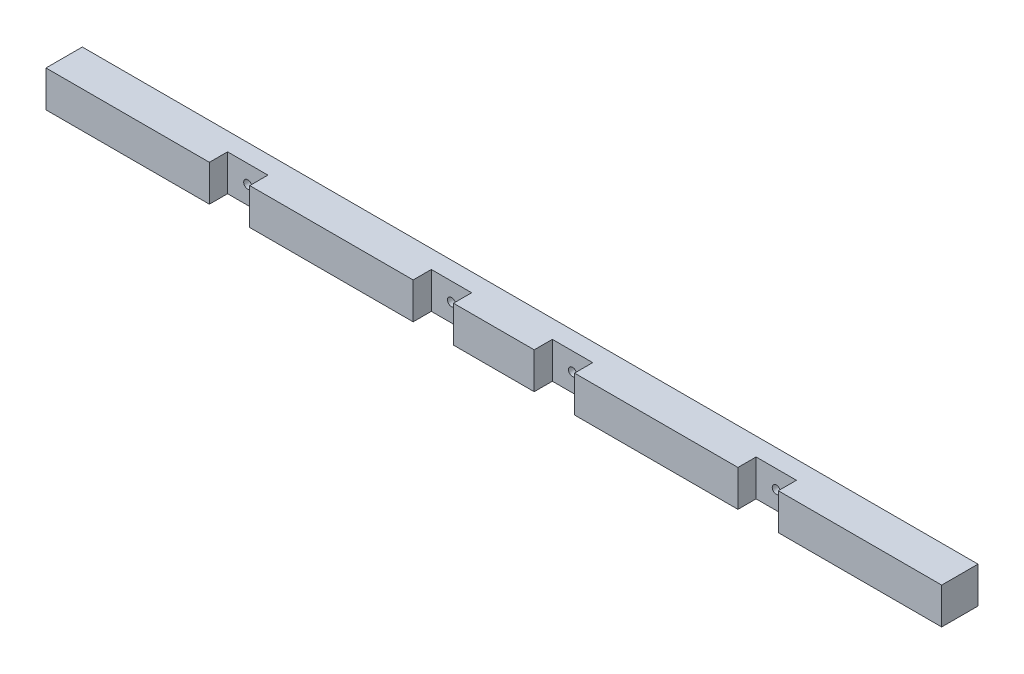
ISO-10303-21;
HEADER;
FILE_DESCRIPTION(('STEP AP214'),'2;1');
FILE_NAME('part.step','',(''),(''),'','','');
FILE_SCHEMA(('AUTOMOTIVE_DESIGN { 1 0 10303 214 1 1 1 1 }'));
ENDSEC;
DATA;
#1=APPLICATION_CONTEXT('core data for automotive mechanical design processes');
#2=APPLICATION_PROTOCOL_DEFINITION('international standard','automotive_design',2000,#1);
#3=PRODUCT_CONTEXT('',#1,'mechanical');
#4=PRODUCT('Part','Part','',(#3));
#5=PRODUCT_RELATED_PRODUCT_CATEGORY('part','',(#4));
#6=PRODUCT_DEFINITION_FORMATION('','',#4);
#7=PRODUCT_DEFINITION_CONTEXT('part definition',#1,'design');
#8=PRODUCT_DEFINITION('design','',#6,#7);
#9=PRODUCT_DEFINITION_SHAPE('','',#8);
#10=(LENGTH_UNIT() NAMED_UNIT(*) SI_UNIT(.MILLI.,.METRE.));
#11=(NAMED_UNIT(*) PLANE_ANGLE_UNIT() SI_UNIT($,.RADIAN.));
#12=(NAMED_UNIT(*) SI_UNIT($,.STERADIAN.) SOLID_ANGLE_UNIT());
#13=UNCERTAINTY_MEASURE_WITH_UNIT(LENGTH_MEASURE(1.E-05),#10,'distance_accuracy_value','');
#14=(GEOMETRIC_REPRESENTATION_CONTEXT(3) GLOBAL_UNCERTAINTY_ASSIGNED_CONTEXT((#13)) GLOBAL_UNIT_ASSIGNED_CONTEXT((#10,
#11,#12)) REPRESENTATION_CONTEXT('',''));
#15=CARTESIAN_POINT('',(0.,0.,0.));
#16=DIRECTION('',(0.,0.,1.));
#17=DIRECTION('',(1.,0.,0.));
#18=AXIS2_PLACEMENT_3D('',#15,#16,#17);
#19=CARTESIAN_POINT('',(0.,9.,9.));
#20=DIRECTION('',(0.,0.,-1.));
#21=DIRECTION('',(-1.,0.,0.));
#22=AXIS2_PLACEMENT_3D('',#19,#20,#21);
#23=PLANE('',#22);
#24=DIRECTION('',(1.,0.,0.));
#25=VECTOR('',#24,1.);
#26=CARTESIAN_POINT('',(0.,0.,9.));
#27=LINE('',#26,#25);
#28=CARTESIAN_POINT('',(131.,0.,9.));
#29=VERTEX_POINT('',#28);
#30=CARTESIAN_POINT('',(171.5,0.,9.));
#31=VERTEX_POINT('',#30);
#32=EDGE_CURVE('E373',#29,#31,#27,.T.);
#33=ORIENTED_EDGE('',*,*,#32,.T.);
#34=DIRECTION('',(0.,-1.,0.));
#35=VECTOR('',#34,1.);
#36=CARTESIAN_POINT('',(171.5,0.,9.));
#37=LINE('',#36,#35);
#38=CARTESIAN_POINT('',(171.5,9.,9.));
#39=VERTEX_POINT('',#38);
#40=EDGE_CURVE('E173',#39,#31,#37,.T.);
#41=ORIENTED_EDGE('',*,*,#40,.F.);
#42=DIRECTION('',(-1.,0.,0.));
#43=VECTOR('',#42,1.);
#44=CARTESIAN_POINT('',(0.,9.,9.));
#45=LINE('',#44,#43);
#46=CARTESIAN_POINT('',(131.,9.,9.));
#47=VERTEX_POINT('',#46);
#48=EDGE_CURVE('E320',#39,#47,#45,.T.);
#49=ORIENTED_EDGE('',*,*,#48,.T.);
#50=DIRECTION('',(0.,1.,0.));
#51=VECTOR('',#50,1.);
#52=CARTESIAN_POINT('',(131.,0.,9.));
#53=LINE('',#52,#51);
#54=EDGE_CURVE('E217',#29,#47,#53,.T.);
#55=ORIENTED_EDGE('',*,*,#54,.F.);
#56=EDGE_LOOP('',(#33,#41,#49,#55));
#57=FACE_BOUND('',#56,.T.);
#58=ADVANCED_FACE('F30',(#57),#23,.F.);
#59=CARTESIAN_POINT('',(101.,0.,9.));
#60=VERTEX_POINT('',#59);
#61=CARTESIAN_POINT('',(121.,0.,9.));
#62=VERTEX_POINT('',#61);
#63=EDGE_CURVE('E374',#60,#62,#27,.T.);
#64=ORIENTED_EDGE('',*,*,#63,.T.);
#65=DIRECTION('',(0.,-1.,0.));
#66=VECTOR('',#65,1.);
#67=CARTESIAN_POINT('',(121.,0.,9.));
#68=LINE('',#67,#66);
#69=CARTESIAN_POINT('',(121.,9.,9.));
#70=VERTEX_POINT('',#69);
#71=EDGE_CURVE('E210',#70,#62,#68,.T.);
#72=ORIENTED_EDGE('',*,*,#71,.F.);
#73=CARTESIAN_POINT('',(101.,9.,9.));
#74=VERTEX_POINT('',#73);
#75=EDGE_CURVE('E357',#70,#74,#45,.T.);
#76=ORIENTED_EDGE('',*,*,#75,.T.);
#77=DIRECTION('',(0.,1.,0.));
#78=VECTOR('',#77,1.);
#79=CARTESIAN_POINT('',(101.,0.,9.));
#80=LINE('',#79,#78);
#81=EDGE_CURVE('E248',#60,#74,#80,.T.);
#82=ORIENTED_EDGE('',*,*,#81,.F.);
#83=EDGE_LOOP('',(#64,#72,#76,#82));
#84=FACE_BOUND('',#83,.T.);
#85=ADVANCED_FACE('F391',(#84),#23,.F.);
#86=CARTESIAN_POINT('',(50.5,0.,9.));
#87=VERTEX_POINT('',#86);
#88=CARTESIAN_POINT('',(91.,0.,9.));
#89=VERTEX_POINT('',#88);
#90=EDGE_CURVE('E313',#87,#89,#27,.T.);
#91=ORIENTED_EDGE('',*,*,#90,.T.);
#92=DIRECTION('',(0.,-1.,0.));
#93=VECTOR('',#92,1.);
#94=CARTESIAN_POINT('',(91.,0.,9.));
#95=LINE('',#94,#93);
#96=CARTESIAN_POINT('',(91.,9.,9.));
#97=VERTEX_POINT('',#96);
#98=EDGE_CURVE('E241',#97,#89,#95,.T.);
#99=ORIENTED_EDGE('',*,*,#98,.F.);
#100=CARTESIAN_POINT('',(50.5,9.,9.));
#101=VERTEX_POINT('',#100);
#102=EDGE_CURVE('E356',#97,#101,#45,.T.);
#103=ORIENTED_EDGE('',*,*,#102,.T.);
#104=DIRECTION('',(0.,1.,0.));
#105=VECTOR('',#104,1.);
#106=CARTESIAN_POINT('',(50.5,9.,9.));
#107=LINE('',#106,#105);
#108=EDGE_CURVE('E281',#87,#101,#107,.T.);
#109=ORIENTED_EDGE('',*,*,#108,.F.);
#110=EDGE_LOOP('',(#91,#99,#103,#109));
#111=FACE_BOUND('',#110,.T.);
#112=ADVANCED_FACE('F396',(#111),#23,.F.);
#113=CARTESIAN_POINT('',(0.,0.,9.));
#114=VERTEX_POINT('',#113);
#115=CARTESIAN_POINT('',(40.5,0.,9.));
#116=VERTEX_POINT('',#115);
#117=EDGE_CURVE('E309',#114,#116,#27,.T.);
#118=ORIENTED_EDGE('',*,*,#117,.T.);
#119=DIRECTION('',(0.,-1.,0.));
#120=VECTOR('',#119,1.);
#121=CARTESIAN_POINT('',(40.5,9.,9.));
#122=LINE('',#121,#120);
#123=CARTESIAN_POINT('',(40.5,9.,9.));
#124=VERTEX_POINT('',#123);
#125=EDGE_CURVE('E274',#124,#116,#122,.T.);
#126=ORIENTED_EDGE('',*,*,#125,.F.);
#127=CARTESIAN_POINT('',(0.,9.,9.));
#128=VERTEX_POINT('',#127);
#129=EDGE_CURVE('E315',#124,#128,#45,.T.);
#130=ORIENTED_EDGE('',*,*,#129,.T.);
#131=DIRECTION('',(0.,-1.,0.));
#132=VECTOR('',#131,1.);
#133=CARTESIAN_POINT('',(0.,0.,9.));
#134=LINE('',#133,#132);
#135=EDGE_CURVE('E304',#128,#114,#134,.T.);
#136=ORIENTED_EDGE('',*,*,#135,.T.);
#137=EDGE_LOOP('',(#118,#126,#130,#136));
#138=FACE_BOUND('',#137,.T.);
#139=ADVANCED_FACE('F353',(#138),#23,.F.);
#140=CARTESIAN_POINT('',(0.,0.,9.));
#141=DIRECTION('',(1.,0.,0.));
#142=DIRECTION('',(0.,0.,-1.));
#143=AXIS2_PLACEMENT_3D('',#140,#141,#142);
#144=PLANE('',#143);
#145=DIRECTION('',(0.,-1.,0.));
#146=VECTOR('',#145,1.);
#147=CARTESIAN_POINT('',(0.,0.,0.));
#148=LINE('',#147,#146);
#149=CARTESIAN_POINT('',(0.,9.,0.));
#150=VERTEX_POINT('',#149);
#151=CARTESIAN_POINT('',(0.,0.,0.));
#152=VERTEX_POINT('',#151);
#153=EDGE_CURVE('E296',#150,#152,#148,.T.);
#154=ORIENTED_EDGE('',*,*,#153,.T.);
#155=DIRECTION('',(0.,0.,-1.));
#156=VECTOR('',#155,1.);
#157=CARTESIAN_POINT('',(0.,0.,9.));
#158=LINE('',#157,#156);
#159=EDGE_CURVE('E11',#114,#152,#158,.T.);
#160=ORIENTED_EDGE('',*,*,#159,.F.);
#161=ORIENTED_EDGE('',*,*,#135,.F.);
#162=DIRECTION('',(0.,0.,-1.));
#163=VECTOR('',#162,1.);
#164=CARTESIAN_POINT('',(0.,9.,9.));
#165=LINE('',#164,#163);
#166=EDGE_CURVE('E319',#128,#150,#165,.T.);
#167=ORIENTED_EDGE('',*,*,#166,.T.);
#168=EDGE_LOOP('',(#154,#160,#161,#167));
#169=FACE_BOUND('',#168,.T.);
#170=ADVANCED_FACE('F32',(#169),#144,.F.);
#171=CARTESIAN_POINT('',(0.,0.,9.));
#172=DIRECTION('',(0.,1.,0.));
#173=DIRECTION('',(0.,0.,1.));
#174=AXIS2_PLACEMENT_3D('',#171,#172,#173);
#175=PLANE('',#174);
#176=DIRECTION('',(1.,0.,0.));
#177=VECTOR('',#176,1.);
#178=CARTESIAN_POINT('',(171.5,0.,4.5));
#179=LINE('',#178,#177);
#180=CARTESIAN_POINT('',(171.5,0.,4.5));
#181=VERTEX_POINT('',#180);
#182=CARTESIAN_POINT('',(181.5,0.,4.5));
#183=VERTEX_POINT('',#182);
#184=EDGE_CURVE('E184',#181,#183,#179,.T.);
#185=ORIENTED_EDGE('',*,*,#184,.F.);
#186=DIRECTION('',(0.,0.,1.));
#187=VECTOR('',#186,1.);
#188=CARTESIAN_POINT('',(171.5,0.,4.5));
#189=LINE('',#188,#187);
#190=EDGE_CURVE('E167',#181,#31,#189,.T.);
#191=ORIENTED_EDGE('',*,*,#190,.T.);
#192=ORIENTED_EDGE('',*,*,#32,.F.);
#193=DIRECTION('',(0.,0.,1.));
#194=VECTOR('',#193,1.);
#195=CARTESIAN_POINT('',(131.,0.,4.5));
#196=LINE('',#195,#194);
#197=CARTESIAN_POINT('',(131.,0.,4.5));
#198=VERTEX_POINT('',#197);
#199=EDGE_CURVE('E53',#198,#29,#196,.T.);
#200=ORIENTED_EDGE('',*,*,#199,.F.);
#201=DIRECTION('',(1.,0.,0.));
#202=VECTOR('',#201,1.);
#203=CARTESIAN_POINT('',(121.,0.,4.5));
#204=LINE('',#203,#202);
#205=CARTESIAN_POINT('',(121.,0.,4.5));
#206=VERTEX_POINT('',#205);
#207=EDGE_CURVE('E216',#206,#198,#204,.T.);
#208=ORIENTED_EDGE('',*,*,#207,.F.);
#209=DIRECTION('',(0.,0.,1.));
#210=VECTOR('',#209,1.);
#211=CARTESIAN_POINT('',(121.,0.,4.5));
#212=LINE('',#211,#210);
#213=EDGE_CURVE('E226',#206,#62,#212,.T.);
#214=ORIENTED_EDGE('',*,*,#213,.T.);
#215=ORIENTED_EDGE('',*,*,#63,.F.);
#216=DIRECTION('',(0.,0.,1.));
#217=VECTOR('',#216,1.);
#218=CARTESIAN_POINT('',(101.,0.,4.5));
#219=LINE('',#218,#217);
#220=CARTESIAN_POINT('',(101.,0.,4.5));
#221=VERTEX_POINT('',#220);
#222=EDGE_CURVE('E267',#221,#60,#219,.T.);
#223=ORIENTED_EDGE('',*,*,#222,.F.);
#224=DIRECTION('',(1.,0.,0.));
#225=VECTOR('',#224,1.);
#226=CARTESIAN_POINT('',(91.,0.,4.5));
#227=LINE('',#226,#225);
#228=CARTESIAN_POINT('',(91.,0.,4.5));
#229=VERTEX_POINT('',#228);
#230=EDGE_CURVE('E247',#229,#221,#227,.T.);
#231=ORIENTED_EDGE('',*,*,#230,.F.);
#232=DIRECTION('',(0.,0.,1.));
#233=VECTOR('',#232,1.);
#234=CARTESIAN_POINT('',(91.,0.,4.5));
#235=LINE('',#234,#233);
#236=EDGE_CURVE('E257',#229,#89,#235,.T.);
#237=ORIENTED_EDGE('',*,*,#236,.T.);
#238=ORIENTED_EDGE('',*,*,#90,.F.);
#239=DIRECTION('',(0.,0.,1.));
#240=VECTOR('',#239,1.);
#241=CARTESIAN_POINT('',(50.5,0.,4.5));
#242=LINE('',#241,#240);
#243=CARTESIAN_POINT('',(50.5,0.,4.5));
#244=VERTEX_POINT('',#243);
#245=EDGE_CURVE('E300',#244,#87,#242,.T.);
#246=ORIENTED_EDGE('',*,*,#245,.F.);
#247=DIRECTION('',(1.,0.,0.));
#248=VECTOR('',#247,1.);
#249=CARTESIAN_POINT('',(40.5,0.,4.5));
#250=LINE('',#249,#248);
#251=CARTESIAN_POINT('',(40.5,0.,4.5));
#252=VERTEX_POINT('',#251);
#253=EDGE_CURVE('E280',#252,#244,#250,.T.);
#254=ORIENTED_EDGE('',*,*,#253,.F.);
#255=DIRECTION('',(0.,0.,1.));
#256=VECTOR('',#255,1.);
#257=CARTESIAN_POINT('',(40.5,0.,4.5));
#258=LINE('',#257,#256);
#259=EDGE_CURVE('E290',#252,#116,#258,.T.);
#260=ORIENTED_EDGE('',*,*,#259,.T.);
#261=ORIENTED_EDGE('',*,*,#117,.F.);
#262=ORIENTED_EDGE('',*,*,#159,.T.);
#263=DIRECTION('',(1.,0.,0.));
#264=VECTOR('',#263,1.);
#265=CARTESIAN_POINT('',(0.,0.,0.));
#266=LINE('',#265,#264);
#267=CARTESIAN_POINT('',(222.,0.,0.));
#268=VERTEX_POINT('',#267);
#269=EDGE_CURVE('E323',#152,#268,#266,.T.);
#270=ORIENTED_EDGE('',*,*,#269,.T.);
#271=DIRECTION('',(0.,0.,-1.));
#272=VECTOR('',#271,1.);
#273=CARTESIAN_POINT('',(222.,0.,9.));
#274=LINE('',#273,#272);
#275=CARTESIAN_POINT('',(222.,0.,9.));
#276=VERTEX_POINT('',#275);
#277=EDGE_CURVE('E38',#276,#268,#274,.T.);
#278=ORIENTED_EDGE('',*,*,#277,.F.);
#279=CARTESIAN_POINT('',(181.5,0.,9.));
#280=VERTEX_POINT('',#279);
#281=EDGE_CURVE('E307',#280,#276,#27,.T.);
#282=ORIENTED_EDGE('',*,*,#281,.F.);
#283=DIRECTION('',(0.,0.,1.));
#284=VECTOR('',#283,1.);
#285=CARTESIAN_POINT('',(181.5,0.,4.5));
#286=LINE('',#285,#284);
#287=EDGE_CURVE('E45',#183,#280,#286,.T.);
#288=ORIENTED_EDGE('',*,*,#287,.F.);
#289=EDGE_LOOP('',(#185,#191,#192,#200,#208,#214,#215,#223,#231,#237,#238,#246,#254,#260,#261,
#262,#270,#278,#282,#288));
#290=FACE_BOUND('',#289,.T.);
#291=ADVANCED_FACE('F189',(#290),#175,.F.);
#292=CARTESIAN_POINT('',(222.,0.,9.));
#293=DIRECTION('',(-1.,0.,0.));
#294=DIRECTION('',(0.,0.,1.));
#295=AXIS2_PLACEMENT_3D('',#292,#293,#294);
#296=PLANE('',#295);
#297=DIRECTION('',(0.,1.,0.));
#298=VECTOR('',#297,1.);
#299=CARTESIAN_POINT('',(222.,0.,0.));
#300=LINE('',#299,#298);
#301=CARTESIAN_POINT('',(222.,9.,0.));
#302=VERTEX_POINT('',#301);
#303=EDGE_CURVE('E325',#268,#302,#300,.T.);
#304=ORIENTED_EDGE('',*,*,#303,.T.);
#305=DIRECTION('',(0.,0.,-1.));
#306=VECTOR('',#305,1.);
#307=CARTESIAN_POINT('',(222.,9.,9.));
#308=LINE('',#307,#306);
#309=CARTESIAN_POINT('',(222.,9.,9.));
#310=VERTEX_POINT('',#309);
#311=EDGE_CURVE('E330',#310,#302,#308,.T.);
#312=ORIENTED_EDGE('',*,*,#311,.F.);
#313=DIRECTION('',(0.,1.,0.));
#314=VECTOR('',#313,1.);
#315=CARTESIAN_POINT('',(222.,0.,9.));
#316=LINE('',#315,#314);
#317=EDGE_CURVE('E312',#276,#310,#316,.T.);
#318=ORIENTED_EDGE('',*,*,#317,.F.);
#319=ORIENTED_EDGE('',*,*,#277,.T.);
#320=EDGE_LOOP('',(#304,#312,#318,#319));
#321=FACE_BOUND('',#320,.T.);
#322=ADVANCED_FACE('F337',(#321),#296,.F.);
#323=CARTESIAN_POINT('',(0.,9.,9.));
#324=DIRECTION('',(0.,-1.,0.));
#325=DIRECTION('',(0.,0.,-1.));
#326=AXIS2_PLACEMENT_3D('',#323,#324,#325);
#327=PLANE('',#326);
#328=ORIENTED_EDGE('',*,*,#48,.F.);
#329=DIRECTION('',(0.,0.,1.));
#330=VECTOR('',#329,1.);
#331=CARTESIAN_POINT('',(171.5,9.,4.5));
#332=LINE('',#331,#330);
#333=CARTESIAN_POINT('',(171.5,9.,4.5));
#334=VERTEX_POINT('',#333);
#335=EDGE_CURVE('E200',#334,#39,#332,.T.);
#336=ORIENTED_EDGE('',*,*,#335,.F.);
#337=DIRECTION('',(-1.,0.,0.));
#338=VECTOR('',#337,1.);
#339=CARTESIAN_POINT('',(171.5,9.,4.5));
#340=LINE('',#339,#338);
#341=CARTESIAN_POINT('',(181.5,9.,4.5));
#342=VERTEX_POINT('',#341);
#343=EDGE_CURVE('E178',#342,#334,#340,.T.);
#344=ORIENTED_EDGE('',*,*,#343,.F.);
#345=DIRECTION('',(0.,0.,1.));
#346=VECTOR('',#345,1.);
#347=CARTESIAN_POINT('',(181.5,9.,4.5));
#348=LINE('',#347,#346);
#349=CARTESIAN_POINT('',(181.5,9.,9.));
#350=VERTEX_POINT('',#349);
#351=EDGE_CURVE('E203',#342,#350,#348,.T.);
#352=ORIENTED_EDGE('',*,*,#351,.T.);
#353=EDGE_CURVE('E316',#310,#350,#45,.T.);
#354=ORIENTED_EDGE('',*,*,#353,.F.);
#355=ORIENTED_EDGE('',*,*,#311,.T.);
#356=DIRECTION('',(-1.,0.,0.));
#357=VECTOR('',#356,1.);
#358=CARTESIAN_POINT('',(0.,9.,0.));
#359=LINE('',#358,#357);
#360=EDGE_CURVE('E308',#302,#150,#359,.T.);
#361=ORIENTED_EDGE('',*,*,#360,.T.);
#362=ORIENTED_EDGE('',*,*,#166,.F.);
#363=ORIENTED_EDGE('',*,*,#129,.F.);
#364=DIRECTION('',(0.,0.,1.));
#365=VECTOR('',#364,1.);
#366=CARTESIAN_POINT('',(40.5,9.,4.5));
#367=LINE('',#366,#365);
#368=CARTESIAN_POINT('',(40.5,9.,4.5));
#369=VERTEX_POINT('',#368);
#370=EDGE_CURVE('E294',#369,#124,#367,.T.);
#371=ORIENTED_EDGE('',*,*,#370,.F.);
#372=DIRECTION('',(-1.,0.,0.));
#373=VECTOR('',#372,1.);
#374=CARTESIAN_POINT('',(40.5,9.,4.5));
#375=LINE('',#374,#373);
#376=CARTESIAN_POINT('',(50.5,9.,4.5));
#377=VERTEX_POINT('',#376);
#378=EDGE_CURVE('E287',#377,#369,#375,.T.);
#379=ORIENTED_EDGE('',*,*,#378,.F.);
#380=DIRECTION('',(0.,0.,1.));
#381=VECTOR('',#380,1.);
#382=CARTESIAN_POINT('',(50.5,9.,4.5));
#383=LINE('',#382,#381);
#384=EDGE_CURVE('E297',#377,#101,#383,.T.);
#385=ORIENTED_EDGE('',*,*,#384,.T.);
#386=ORIENTED_EDGE('',*,*,#102,.F.);
#387=DIRECTION('',(0.,0.,1.));
#388=VECTOR('',#387,1.);
#389=CARTESIAN_POINT('',(91.,9.,4.5));
#390=LINE('',#389,#388);
#391=CARTESIAN_POINT('',(91.,9.,4.5));
#392=VERTEX_POINT('',#391);
#393=EDGE_CURVE('E261',#392,#97,#390,.T.);
#394=ORIENTED_EDGE('',*,*,#393,.F.);
#395=DIRECTION('',(-1.,0.,0.));
#396=VECTOR('',#395,1.);
#397=CARTESIAN_POINT('',(91.,9.,4.5));
#398=LINE('',#397,#396);
#399=CARTESIAN_POINT('',(101.,9.,4.5));
#400=VERTEX_POINT('',#399);
#401=EDGE_CURVE('E254',#400,#392,#398,.T.);
#402=ORIENTED_EDGE('',*,*,#401,.F.);
#403=DIRECTION('',(0.,0.,1.));
#404=VECTOR('',#403,1.);
#405=CARTESIAN_POINT('',(101.,9.,4.5));
#406=LINE('',#405,#404);
#407=EDGE_CURVE('E264',#400,#74,#406,.T.);
#408=ORIENTED_EDGE('',*,*,#407,.T.);
#409=ORIENTED_EDGE('',*,*,#75,.F.);
#410=DIRECTION('',(0.,0.,1.));
#411=VECTOR('',#410,1.);
#412=CARTESIAN_POINT('',(121.,9.,4.5));
#413=LINE('',#412,#411);
#414=CARTESIAN_POINT('',(121.,9.,4.5));
#415=VERTEX_POINT('',#414);
#416=EDGE_CURVE('E229',#415,#70,#413,.T.);
#417=ORIENTED_EDGE('',*,*,#416,.F.);
#418=DIRECTION('',(-1.,0.,0.));
#419=VECTOR('',#418,1.);
#420=CARTESIAN_POINT('',(121.,9.,4.5));
#421=LINE('',#420,#419);
#422=CARTESIAN_POINT('',(131.,9.,4.5));
#423=VERTEX_POINT('',#422);
#424=EDGE_CURVE('E223',#423,#415,#421,.T.);
#425=ORIENTED_EDGE('',*,*,#424,.F.);
#426=DIRECTION('',(0.,0.,1.));
#427=VECTOR('',#426,1.);
#428=CARTESIAN_POINT('',(131.,9.,4.5));
#429=LINE('',#428,#427);
#430=EDGE_CURVE('E232',#423,#47,#429,.T.);
#431=ORIENTED_EDGE('',*,*,#430,.T.);
#432=EDGE_LOOP('',(#328,#336,#344,#352,#354,#355,#361,#362,#363,#371,#379,#385,#386,#394,#402,
#408,#409,#417,#425,#431));
#433=FACE_BOUND('',#432,.T.);
#434=ADVANCED_FACE('F346',(#433),#327,.F.);
#435=ORIENTED_EDGE('',*,*,#353,.T.);
#436=DIRECTION('',(0.,1.,0.));
#437=VECTOR('',#436,1.);
#438=CARTESIAN_POINT('',(181.5,0.,9.));
#439=LINE('',#438,#437);
#440=EDGE_CURVE('E187',#280,#350,#439,.T.);
#441=ORIENTED_EDGE('',*,*,#440,.F.);
#442=ORIENTED_EDGE('',*,*,#281,.T.);
#443=ORIENTED_EDGE('',*,*,#317,.T.);
#444=EDGE_LOOP('',(#435,#441,#442,#443));
#445=FACE_BOUND('',#444,.T.);
#446=ADVANCED_FACE('F377',(#445),#23,.F.);
#447=CARTESIAN_POINT('',(0.,9.,0.));
#448=DIRECTION('',(0.,0.,-1.));
#449=DIRECTION('',(-1.,0.,0.));
#450=AXIS2_PLACEMENT_3D('',#447,#448,#449);
#451=PLANE('',#450);
#452=CARTESIAN_POINT('',(176.5,4.5,0.));
#453=DIRECTION('',(0.,0.,1.));
#454=DIRECTION('',(1.,0.,0.));
#455=AXIS2_PLACEMENT_3D('',#452,#453,#454);
#456=CIRCLE('',#455,0.999999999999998);
#457=CARTESIAN_POINT('',(177.5,4.5,0.));
#458=VERTEX_POINT('',#457);
#459=EDGE_CURVE('E198',#458,#458,#456,.T.);
#460=ORIENTED_EDGE('',*,*,#459,.T.);
#461=EDGE_LOOP('',(#460));
#462=FACE_BOUND('',#461,.T.);
#463=CARTESIAN_POINT('',(126.,4.5,0.));
#464=DIRECTION('',(0.,0.,1.));
#465=DIRECTION('',(1.,0.,0.));
#466=AXIS2_PLACEMENT_3D('',#463,#464,#465);
#467=CIRCLE('',#466,0.999999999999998);
#468=CARTESIAN_POINT('',(127.,4.5,0.));
#469=VERTEX_POINT('',#468);
#470=EDGE_CURVE('E207',#469,#469,#467,.T.);
#471=ORIENTED_EDGE('',*,*,#470,.T.);
#472=EDGE_LOOP('',(#471));
#473=FACE_BOUND('',#472,.T.);
#474=CARTESIAN_POINT('',(96.,4.5,0.));
#475=DIRECTION('',(0.,0.,1.));
#476=DIRECTION('',(1.,0.,0.));
#477=AXIS2_PLACEMENT_3D('',#474,#475,#476);
#478=CIRCLE('',#477,0.999999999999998);
#479=CARTESIAN_POINT('',(97.,4.5,0.));
#480=VERTEX_POINT('',#479);
#481=EDGE_CURVE('E238',#480,#480,#478,.T.);
#482=ORIENTED_EDGE('',*,*,#481,.T.);
#483=EDGE_LOOP('',(#482));
#484=FACE_BOUND('',#483,.T.);
#485=CARTESIAN_POINT('',(45.5,4.5,0.));
#486=DIRECTION('',(0.,0.,1.));
#487=DIRECTION('',(1.,0.,0.));
#488=AXIS2_PLACEMENT_3D('',#485,#486,#487);
#489=CIRCLE('',#488,0.999999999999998);
#490=CARTESIAN_POINT('',(46.5,4.5,0.));
#491=VERTEX_POINT('',#490);
#492=EDGE_CURVE('E271',#491,#491,#489,.T.);
#493=ORIENTED_EDGE('',*,*,#492,.T.);
#494=EDGE_LOOP('',(#493));
#495=FACE_BOUND('',#494,.T.);
#496=ORIENTED_EDGE('',*,*,#153,.F.);
#497=ORIENTED_EDGE('',*,*,#360,.F.);
#498=ORIENTED_EDGE('',*,*,#303,.F.);
#499=ORIENTED_EDGE('',*,*,#269,.F.);
#500=EDGE_LOOP('',(#496,#497,#498,#499));
#501=FACE_BOUND('',#500,.T.);
#502=ADVANCED_FACE('F342',(#462,#473,#484,#495,#501),#451,.T.);
#503=CARTESIAN_POINT('',(40.5,9.,4.5));
#504=DIRECTION('',(-1.,0.,0.));
#505=DIRECTION('',(0.,0.,1.));
#506=AXIS2_PLACEMENT_3D('',#503,#504,#505);
#507=PLANE('',#506);
#508=ORIENTED_EDGE('',*,*,#125,.T.);
#509=ORIENTED_EDGE('',*,*,#259,.F.);
#510=DIRECTION('',(0.,-1.,0.));
#511=VECTOR('',#510,1.);
#512=CARTESIAN_POINT('',(40.5,9.,4.5));
#513=LINE('',#512,#511);
#514=EDGE_CURVE('E277',#369,#252,#513,.T.);
#515=ORIENTED_EDGE('',*,*,#514,.F.);
#516=ORIENTED_EDGE('',*,*,#370,.T.);
#517=EDGE_LOOP('',(#508,#509,#515,#516));
#518=FACE_BOUND('',#517,.T.);
#519=ADVANCED_FACE('F404',(#518),#507,.F.);
#520=CARTESIAN_POINT('',(50.5,9.,4.5));
#521=DIRECTION('',(1.,0.,0.));
#522=DIRECTION('',(0.,0.,-1.));
#523=AXIS2_PLACEMENT_3D('',#520,#521,#522);
#524=PLANE('',#523);
#525=ORIENTED_EDGE('',*,*,#108,.T.);
#526=ORIENTED_EDGE('',*,*,#384,.F.);
#527=DIRECTION('',(0.,1.,0.));
#528=VECTOR('',#527,1.);
#529=CARTESIAN_POINT('',(50.5,9.,4.5));
#530=LINE('',#529,#528);
#531=EDGE_CURVE('E284',#244,#377,#530,.T.);
#532=ORIENTED_EDGE('',*,*,#531,.F.);
#533=ORIENTED_EDGE('',*,*,#245,.T.);
#534=EDGE_LOOP('',(#525,#526,#532,#533));
#535=FACE_BOUND('',#534,.T.);
#536=ADVANCED_FACE('F428',(#535),#524,.F.);
#537=CARTESIAN_POINT('',(40.5,0.,4.5));
#538=DIRECTION('',(0.,0.,1.));
#539=DIRECTION('',(1.,0.,0.));
#540=AXIS2_PLACEMENT_3D('',#537,#538,#539);
#541=PLANE('',#540);
#542=CARTESIAN_POINT('',(45.5,4.5,4.5));
#543=DIRECTION('',(0.,0.,1.));
#544=DIRECTION('',(1.,0.,0.));
#545=AXIS2_PLACEMENT_3D('',#542,#543,#544);
#546=CIRCLE('',#545,0.999999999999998);
#547=CARTESIAN_POINT('',(46.5,4.5,4.5));
#548=VERTEX_POINT('',#547);
#549=EDGE_CURVE('E263',#548,#548,#546,.T.);
#550=ORIENTED_EDGE('',*,*,#549,.F.);
#551=EDGE_LOOP('',(#550));
#552=FACE_BOUND('',#551,.T.);
#553=ORIENTED_EDGE('',*,*,#514,.T.);
#554=ORIENTED_EDGE('',*,*,#253,.T.);
#555=ORIENTED_EDGE('',*,*,#531,.T.);
#556=ORIENTED_EDGE('',*,*,#378,.T.);
#557=EDGE_LOOP('',(#553,#554,#555,#556));
#558=FACE_BOUND('',#557,.T.);
#559=ADVANCED_FACE('F430',(#552,#558),#541,.T.);
#560=CARTESIAN_POINT('',(45.5,4.5,0.));
#561=DIRECTION('',(0.,0.,1.));
#562=DIRECTION('',(1.,0.,0.));
#563=AXIS2_PLACEMENT_3D('',#560,#561,#562);
#564=CYLINDRICAL_SURFACE('',#563,0.999999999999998);
#565=ORIENTED_EDGE('',*,*,#492,.F.);
#566=EDGE_LOOP('',(#565));
#567=FACE_BOUND('',#566,.T.);
#568=ORIENTED_EDGE('',*,*,#549,.T.);
#569=EDGE_LOOP('',(#568));
#570=FACE_BOUND('',#569,.T.);
#571=ADVANCED_FACE('F440',(#567,#570),#564,.F.);
#572=CARTESIAN_POINT('',(91.,0.,4.5));
#573=DIRECTION('',(-1.,0.,0.));
#574=DIRECTION('',(0.,0.,1.));
#575=AXIS2_PLACEMENT_3D('',#572,#573,#574);
#576=PLANE('',#575);
#577=ORIENTED_EDGE('',*,*,#98,.T.);
#578=ORIENTED_EDGE('',*,*,#236,.F.);
#579=DIRECTION('',(0.,-1.,0.));
#580=VECTOR('',#579,1.);
#581=CARTESIAN_POINT('',(91.,0.,4.5));
#582=LINE('',#581,#580);
#583=EDGE_CURVE('E244',#392,#229,#582,.T.);
#584=ORIENTED_EDGE('',*,*,#583,.F.);
#585=ORIENTED_EDGE('',*,*,#393,.T.);
#586=EDGE_LOOP('',(#577,#578,#584,#585));
#587=FACE_BOUND('',#586,.T.);
#588=ADVANCED_FACE('F421',(#587),#576,.F.);
#589=CARTESIAN_POINT('',(101.,0.,4.5));
#590=DIRECTION('',(1.,0.,0.));
#591=DIRECTION('',(0.,0.,-1.));
#592=AXIS2_PLACEMENT_3D('',#589,#590,#591);
#593=PLANE('',#592);
#594=ORIENTED_EDGE('',*,*,#81,.T.);
#595=ORIENTED_EDGE('',*,*,#407,.F.);
#596=DIRECTION('',(0.,1.,0.));
#597=VECTOR('',#596,1.);
#598=CARTESIAN_POINT('',(101.,0.,4.5));
#599=LINE('',#598,#597);
#600=EDGE_CURVE('E251',#221,#400,#599,.T.);
#601=ORIENTED_EDGE('',*,*,#600,.F.);
#602=ORIENTED_EDGE('',*,*,#222,.T.);
#603=EDGE_LOOP('',(#594,#595,#601,#602));
#604=FACE_BOUND('',#603,.T.);
#605=ADVANCED_FACE('F447',(#604),#593,.F.);
#606=CARTESIAN_POINT('',(91.,9.,4.5));
#607=DIRECTION('',(0.,0.,-1.));
#608=DIRECTION('',(-1.,0.,0.));
#609=AXIS2_PLACEMENT_3D('',#606,#607,#608);
#610=PLANE('',#609);
#611=CARTESIAN_POINT('',(96.,4.5,4.5));
#612=DIRECTION('',(0.,0.,1.));
#613=DIRECTION('',(1.,0.,0.));
#614=AXIS2_PLACEMENT_3D('',#611,#612,#613);
#615=CIRCLE('',#614,0.999999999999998);
#616=CARTESIAN_POINT('',(97.,4.5,4.5));
#617=VERTEX_POINT('',#616);
#618=EDGE_CURVE('E231',#617,#617,#615,.T.);
#619=ORIENTED_EDGE('',*,*,#618,.F.);
#620=EDGE_LOOP('',(#619));
#621=FACE_BOUND('',#620,.T.);
#622=ORIENTED_EDGE('',*,*,#583,.T.);
#623=ORIENTED_EDGE('',*,*,#230,.T.);
#624=ORIENTED_EDGE('',*,*,#600,.T.);
#625=ORIENTED_EDGE('',*,*,#401,.T.);
#626=EDGE_LOOP('',(#622,#623,#624,#625));
#627=FACE_BOUND('',#626,.T.);
#628=ADVANCED_FACE('F423',(#621,#627),#610,.F.);
#629=CARTESIAN_POINT('',(96.,4.5,0.));
#630=DIRECTION('',(0.,0.,1.));
#631=DIRECTION('',(1.,0.,0.));
#632=AXIS2_PLACEMENT_3D('',#629,#630,#631);
#633=CYLINDRICAL_SURFACE('',#632,0.999999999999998);
#634=ORIENTED_EDGE('',*,*,#481,.F.);
#635=EDGE_LOOP('',(#634));
#636=FACE_BOUND('',#635,.T.);
#637=ORIENTED_EDGE('',*,*,#618,.T.);
#638=EDGE_LOOP('',(#637));
#639=FACE_BOUND('',#638,.T.);
#640=ADVANCED_FACE('F453',(#636,#639),#633,.F.);
#641=CARTESIAN_POINT('',(121.,0.,4.5));
#642=DIRECTION('',(-1.,0.,0.));
#643=DIRECTION('',(0.,0.,1.));
#644=AXIS2_PLACEMENT_3D('',#641,#642,#643);
#645=PLANE('',#644);
#646=ORIENTED_EDGE('',*,*,#71,.T.);
#647=ORIENTED_EDGE('',*,*,#213,.F.);
#648=DIRECTION('',(0.,-1.,0.));
#649=VECTOR('',#648,1.);
#650=CARTESIAN_POINT('',(121.,0.,4.5));
#651=LINE('',#650,#649);
#652=EDGE_CURVE('E213',#415,#206,#651,.T.);
#653=ORIENTED_EDGE('',*,*,#652,.F.);
#654=ORIENTED_EDGE('',*,*,#416,.T.);
#655=EDGE_LOOP('',(#646,#647,#653,#654));
#656=FACE_BOUND('',#655,.T.);
#657=ADVANCED_FACE('F457',(#656),#645,.F.);
#658=CARTESIAN_POINT('',(131.,0.,4.5));
#659=DIRECTION('',(1.,0.,0.));
#660=DIRECTION('',(0.,0.,-1.));
#661=AXIS2_PLACEMENT_3D('',#658,#659,#660);
#662=PLANE('',#661);
#663=ORIENTED_EDGE('',*,*,#54,.T.);
#664=ORIENTED_EDGE('',*,*,#430,.F.);
#665=DIRECTION('',(0.,1.,0.));
#666=VECTOR('',#665,1.);
#667=CARTESIAN_POINT('',(131.,0.,4.5));
#668=LINE('',#667,#666);
#669=EDGE_CURVE('E220',#198,#423,#668,.T.);
#670=ORIENTED_EDGE('',*,*,#669,.F.);
#671=ORIENTED_EDGE('',*,*,#199,.T.);
#672=EDGE_LOOP('',(#663,#664,#670,#671));
#673=FACE_BOUND('',#672,.T.);
#674=ADVANCED_FACE('F367',(#673),#662,.F.);
#675=CARTESIAN_POINT('',(121.,9.,4.5));
#676=DIRECTION('',(0.,0.,-1.));
#677=DIRECTION('',(-1.,0.,0.));
#678=AXIS2_PLACEMENT_3D('',#675,#676,#677);
#679=PLANE('',#678);
#680=CARTESIAN_POINT('',(126.,4.5,4.5));
#681=DIRECTION('',(0.,0.,1.));
#682=DIRECTION('',(1.,0.,0.));
#683=AXIS2_PLACEMENT_3D('',#680,#681,#682);
#684=CIRCLE('',#683,0.999999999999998);
#685=CARTESIAN_POINT('',(127.,4.5,4.5));
#686=VERTEX_POINT('',#685);
#687=EDGE_CURVE('E202',#686,#686,#684,.T.);
#688=ORIENTED_EDGE('',*,*,#687,.F.);
#689=EDGE_LOOP('',(#688));
#690=FACE_BOUND('',#689,.T.);
#691=ORIENTED_EDGE('',*,*,#652,.T.);
#692=ORIENTED_EDGE('',*,*,#207,.T.);
#693=ORIENTED_EDGE('',*,*,#669,.T.);
#694=ORIENTED_EDGE('',*,*,#424,.T.);
#695=EDGE_LOOP('',(#691,#692,#693,#694));
#696=FACE_BOUND('',#695,.T.);
#697=ADVANCED_FACE('F371',(#690,#696),#679,.F.);
#698=CARTESIAN_POINT('',(126.,4.5,0.));
#699=DIRECTION('',(0.,0.,1.));
#700=DIRECTION('',(1.,0.,0.));
#701=AXIS2_PLACEMENT_3D('',#698,#699,#700);
#702=CYLINDRICAL_SURFACE('',#701,0.999999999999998);
#703=ORIENTED_EDGE('',*,*,#470,.F.);
#704=EDGE_LOOP('',(#703));
#705=FACE_BOUND('',#704,.T.);
#706=ORIENTED_EDGE('',*,*,#687,.T.);
#707=EDGE_LOOP('',(#706));
#708=FACE_BOUND('',#707,.T.);
#709=ADVANCED_FACE('F388',(#705,#708),#702,.F.);
#710=CARTESIAN_POINT('',(171.5,0.,4.5));
#711=DIRECTION('',(-1.,0.,0.));
#712=DIRECTION('',(0.,0.,1.));
#713=AXIS2_PLACEMENT_3D('',#710,#711,#712);
#714=PLANE('',#713);
#715=ORIENTED_EDGE('',*,*,#40,.T.);
#716=ORIENTED_EDGE('',*,*,#190,.F.);
#717=DIRECTION('',(0.,-1.,0.));
#718=VECTOR('',#717,1.);
#719=CARTESIAN_POINT('',(171.5,0.,4.5));
#720=LINE('',#719,#718);
#721=EDGE_CURVE('E170',#334,#181,#720,.T.);
#722=ORIENTED_EDGE('',*,*,#721,.F.);
#723=ORIENTED_EDGE('',*,*,#335,.T.);
#724=EDGE_LOOP('',(#715,#716,#722,#723));
#725=FACE_BOUND('',#724,.T.);
#726=ADVANCED_FACE('F169',(#725),#714,.F.);
#727=CARTESIAN_POINT('',(181.5,0.,4.5));
#728=DIRECTION('',(1.,0.,0.));
#729=DIRECTION('',(0.,0.,-1.));
#730=AXIS2_PLACEMENT_3D('',#727,#728,#729);
#731=PLANE('',#730);
#732=ORIENTED_EDGE('',*,*,#440,.T.);
#733=ORIENTED_EDGE('',*,*,#351,.F.);
#734=DIRECTION('',(0.,1.,0.));
#735=VECTOR('',#734,1.);
#736=CARTESIAN_POINT('',(181.5,0.,4.5));
#737=LINE('',#736,#735);
#738=EDGE_CURVE('E191',#183,#342,#737,.T.);
#739=ORIENTED_EDGE('',*,*,#738,.F.);
#740=ORIENTED_EDGE('',*,*,#287,.T.);
#741=EDGE_LOOP('',(#732,#733,#739,#740));
#742=FACE_BOUND('',#741,.T.);
#743=ADVANCED_FACE('F378',(#742),#731,.F.);
#744=CARTESIAN_POINT('',(171.5,9.,4.5));
#745=DIRECTION('',(0.,0.,-1.));
#746=DIRECTION('',(-1.,0.,0.));
#747=AXIS2_PLACEMENT_3D('',#744,#745,#746);
#748=PLANE('',#747);
#749=CARTESIAN_POINT('',(176.5,4.5,4.5));
#750=DIRECTION('',(0.,0.,1.));
#751=DIRECTION('',(1.,0.,0.));
#752=AXIS2_PLACEMENT_3D('',#749,#750,#751);
#753=CIRCLE('',#752,0.999999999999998);
#754=CARTESIAN_POINT('',(177.5,4.5,4.5));
#755=VERTEX_POINT('',#754);
#756=EDGE_CURVE('E528',#755,#755,#753,.T.);
#757=ORIENTED_EDGE('',*,*,#756,.F.);
#758=EDGE_LOOP('',(#757));
#759=FACE_BOUND('',#758,.T.);
#760=ORIENTED_EDGE('',*,*,#721,.T.);
#761=ORIENTED_EDGE('',*,*,#184,.T.);
#762=ORIENTED_EDGE('',*,*,#738,.T.);
#763=ORIENTED_EDGE('',*,*,#343,.T.);
#764=EDGE_LOOP('',(#760,#761,#762,#763));
#765=FACE_BOUND('',#764,.T.);
#766=ADVANCED_FACE('F182',(#759,#765),#748,.F.);
#767=CARTESIAN_POINT('',(176.5,4.5,0.));
#768=DIRECTION('',(0.,0.,1.));
#769=DIRECTION('',(1.,0.,0.));
#770=AXIS2_PLACEMENT_3D('',#767,#768,#769);
#771=CYLINDRICAL_SURFACE('',#770,0.999999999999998);
#772=ORIENTED_EDGE('',*,*,#459,.F.);
#773=EDGE_LOOP('',(#772));
#774=FACE_BOUND('',#773,.T.);
#775=ORIENTED_EDGE('',*,*,#756,.T.);
#776=EDGE_LOOP('',(#775));
#777=FACE_BOUND('',#776,.T.);
#778=ADVANCED_FACE('F385',(#774,#777),#771,.F.);
#779=CLOSED_SHELL('',(#58,#85,#112,#139,#170,#291,#322,#434,#446,#502,#519,#536,#559,#571,#588,
#605,#628,#640,#657,#674,#697,#709,#726,#743,#766,#778));
#780=MANIFOLD_SOLID_BREP('B2',#779);
#781=ADVANCED_BREP_SHAPE_REPRESENTATION('',(#18,#780),#14);
#782=SHAPE_DEFINITION_REPRESENTATION(#9,#781);
ENDSEC;
END-ISO-10303-21;
